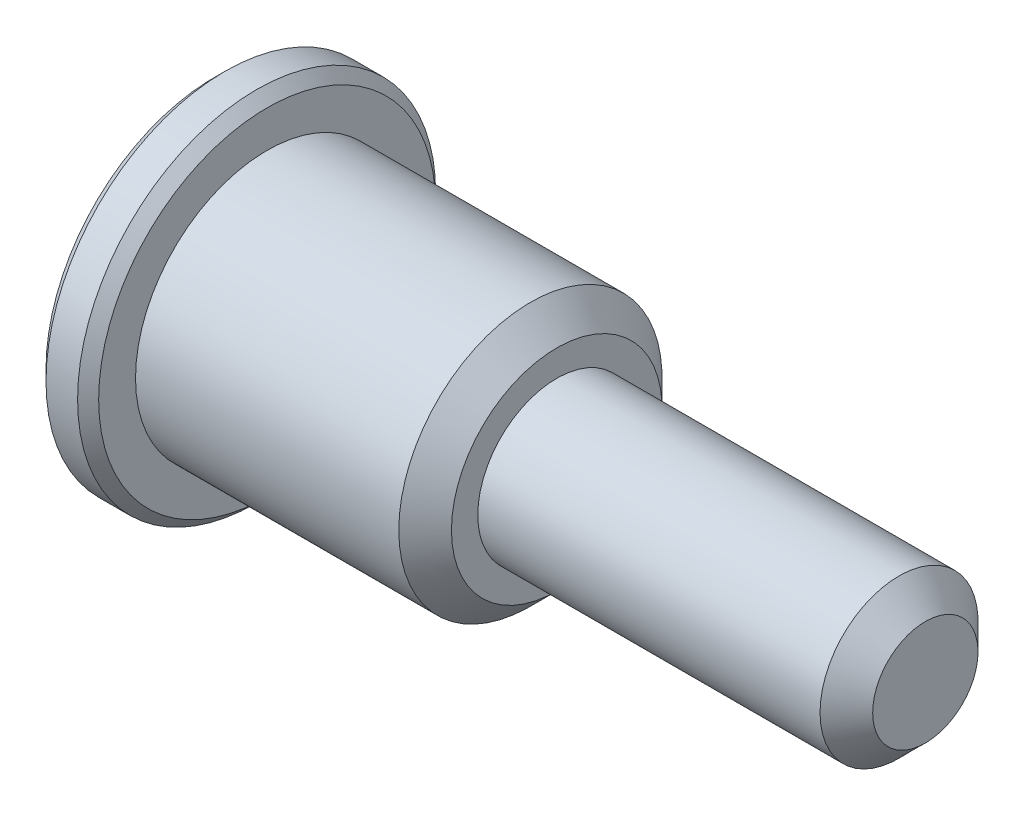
from build123d import *

# Parameters (mm, degrees)
CHAMFER_1_SIZE = 0.5
CHAMFER_2_SIZE = 0.2


with BuildPart() as part:
    # Sketch 1 → Revolve 1 (revolve)
    with BuildSketch(Plane.XY, mode=Mode.PRIVATE) as revolve_1_sk:
        Polygon((0, 0), (0, 3.4), (1, 3.4), (1, 2.5), (6.5, 2.5), (6.5, 1.5), (13.5, 1.5), (13.5, 0), align=None)
    revolve(revolve_1_sk.sketch.rotate(Axis((0, 0, 0), (1, 0, 0)), 90), axis=Axis((0, 0, 0), (1, 0, 0)))

    # Chamfer 1
    chamfer_1_edges = [part.edges().sort_by_distance(p)[0] for p in [
        (13.5, 0, -1.5),
        (6.5, 0, -2.5),
    ]]
    chamfer(chamfer_1_edges, length=CHAMFER_1_SIZE)

    # Chamfer 2
    chamfer_2_edges = [part.edges().sort_by_distance(p)[0] for p in [
        (1, 0, -3.4),
        (0, 0, -3.4),
    ]]
    chamfer(chamfer_2_edges, length=CHAMFER_2_SIZE)


solid = part.part
